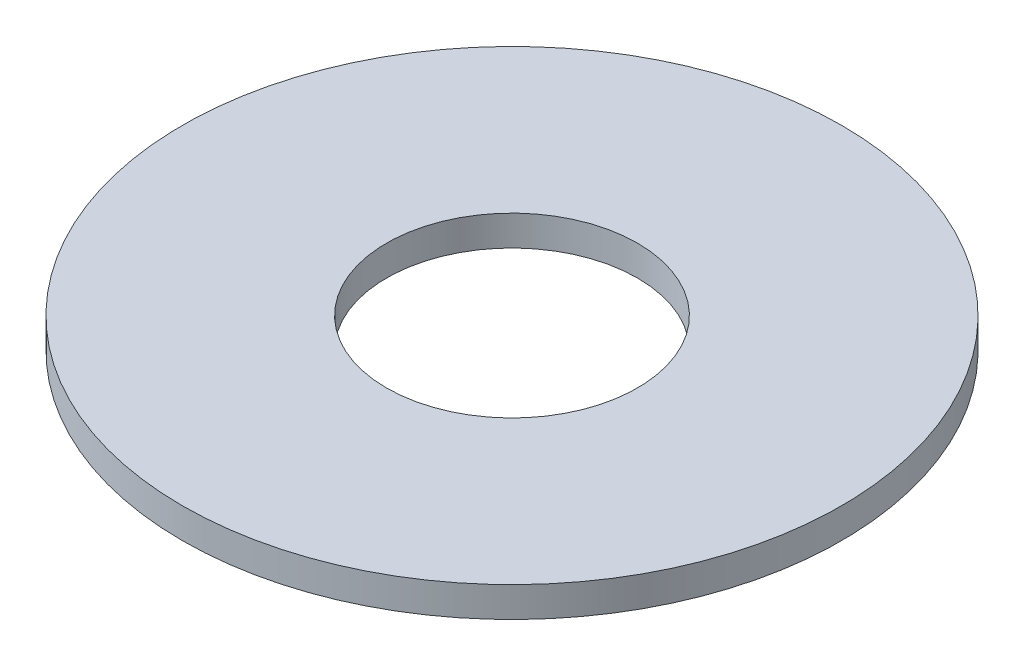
from build123d import *

# Parameters (mm, degrees)
ESQUISSE1_W = 6.75
ESQUISSE1_H = 1


with BuildPart() as part:
    # Esquisse1 → R_volution1 (revolve)
    with BuildSketch(Plane.XY, mode=Mode.PRIVATE) as r_volution1_sk:
        with Locations((7.525, 0.5)):
            Rectangle(ESQUISSE1_W, ESQUISSE1_H)
    revolve(r_volution1_sk.sketch.rotate(Axis((0, 41.634165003, 0), (0, -1, 0)), 90), axis=Axis((0, 41.634165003, 0), (0, -1, 0)))


solid = part.part
